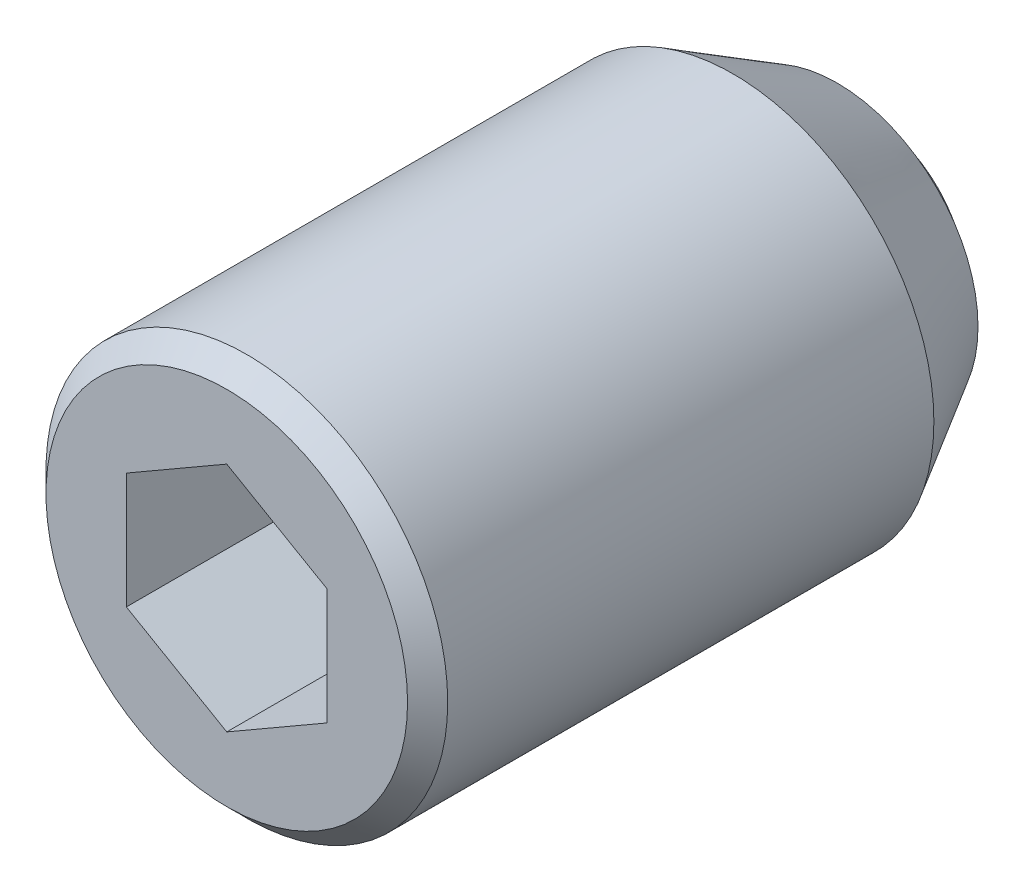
ISO-10303-21;
HEADER;
FILE_DESCRIPTION(('STEP AP214'),'2;1');
FILE_NAME('part.step','',(''),(''),'','','');
FILE_SCHEMA(('AUTOMOTIVE_DESIGN { 1 0 10303 214 1 1 1 1 }'));
ENDSEC;
DATA;
#1=APPLICATION_CONTEXT('core data for automotive mechanical design processes');
#2=APPLICATION_PROTOCOL_DEFINITION('international standard','automotive_design',2000,#1);
#3=PRODUCT_CONTEXT('',#1,'mechanical');
#4=PRODUCT('Part','Part','',(#3));
#5=PRODUCT_RELATED_PRODUCT_CATEGORY('part','',(#4));
#6=PRODUCT_DEFINITION_FORMATION('','',#4);
#7=PRODUCT_DEFINITION_CONTEXT('part definition',#1,'design');
#8=PRODUCT_DEFINITION('design','',#6,#7);
#9=PRODUCT_DEFINITION_SHAPE('','',#8);
#10=(LENGTH_UNIT() NAMED_UNIT(*) SI_UNIT(.MILLI.,.METRE.));
#11=(NAMED_UNIT(*) PLANE_ANGLE_UNIT() SI_UNIT($,.RADIAN.));
#12=(NAMED_UNIT(*) SI_UNIT($,.STERADIAN.) SOLID_ANGLE_UNIT());
#13=UNCERTAINTY_MEASURE_WITH_UNIT(LENGTH_MEASURE(1.E-05),#10,'distance_accuracy_value','');
#14=(GEOMETRIC_REPRESENTATION_CONTEXT(3) GLOBAL_UNCERTAINTY_ASSIGNED_CONTEXT((#13)) GLOBAL_UNIT_ASSIGNED_CONTEXT((#10,
#11,#12)) REPRESENTATION_CONTEXT('',''));
#15=CARTESIAN_POINT('',(0.,0.,0.));
#16=DIRECTION('',(0.,0.,1.));
#17=DIRECTION('',(1.,0.,0.));
#18=AXIS2_PLACEMENT_3D('',#15,#16,#17);
#19=CARTESIAN_POINT('',(1.25,0.721687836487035,5.5));
#20=DIRECTION('',(0.5,0.866025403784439,0.));
#21=DIRECTION('',(0.866025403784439,-0.5,0.));
#22=AXIS2_PLACEMENT_3D('',#19,#20,#21);
#23=PLANE('',#22);
#24=DIRECTION('',(0.,0.,1.));
#25=VECTOR('',#24,1.);
#26=CARTESIAN_POINT('',(1.25,0.721687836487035,5.5));
#27=LINE('',#26,#25);
#28=CARTESIAN_POINT('',(1.25,0.721687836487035,5.5));
#29=VERTEX_POINT('',#28);
#30=CARTESIAN_POINT('',(1.25,0.721687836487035,8.));
#31=VERTEX_POINT('',#30);
#32=EDGE_CURVE('E96',#29,#31,#27,.T.);
#33=ORIENTED_EDGE('',*,*,#32,.T.);
#34=DIRECTION('',(-0.866025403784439,0.5,0.));
#35=VECTOR('',#34,1.);
#36=CARTESIAN_POINT('',(1.25,0.721687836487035,8.));
#37=LINE('',#36,#35);
#38=CARTESIAN_POINT('',(0.,1.44337567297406,8.));
#39=VERTEX_POINT('',#38);
#40=EDGE_CURVE('E29',#31,#39,#37,.T.);
#41=ORIENTED_EDGE('',*,*,#40,.T.);
#42=DIRECTION('',(0.,0.,1.));
#43=VECTOR('',#42,1.);
#44=CARTESIAN_POINT('',(0.,1.44337567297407,5.5));
#45=LINE('',#44,#43);
#46=CARTESIAN_POINT('',(0.,1.44337567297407,5.5));
#47=VERTEX_POINT('',#46);
#48=EDGE_CURVE('E34',#47,#39,#45,.T.);
#49=ORIENTED_EDGE('',*,*,#48,.F.);
#50=DIRECTION('',(-0.866025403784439,0.5,0.));
#51=VECTOR('',#50,1.);
#52=CARTESIAN_POINT('',(1.25,0.721687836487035,5.5));
#53=LINE('',#52,#51);
#54=EDGE_CURVE('E90',#29,#47,#53,.T.);
#55=ORIENTED_EDGE('',*,*,#54,.F.);
#56=EDGE_LOOP('',(#33,#41,#49,#55));
#57=FACE_BOUND('',#56,.T.);
#58=ADVANCED_FACE('F14',(#57),#23,.F.);
#59=CARTESIAN_POINT('',(1.25,-0.721687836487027,5.5));
#60=DIRECTION('',(1.,0.,0.));
#61=DIRECTION('',(0.,-1.,0.));
#62=AXIS2_PLACEMENT_3D('',#59,#60,#61);
#63=PLANE('',#62);
#64=DIRECTION('',(0.,0.,1.));
#65=VECTOR('',#64,1.);
#66=CARTESIAN_POINT('',(1.25,-0.721687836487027,5.5));
#67=LINE('',#66,#65);
#68=CARTESIAN_POINT('',(1.25,-0.721687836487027,5.5));
#69=VERTEX_POINT('',#68);
#70=CARTESIAN_POINT('',(1.25,-0.721687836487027,8.));
#71=VERTEX_POINT('',#70);
#72=EDGE_CURVE('E93',#69,#71,#67,.T.);
#73=ORIENTED_EDGE('',*,*,#72,.T.);
#74=DIRECTION('',(0.,1.,0.));
#75=VECTOR('',#74,1.);
#76=CARTESIAN_POINT('',(1.25,-0.721687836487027,8.));
#77=LINE('',#76,#75);
#78=EDGE_CURVE('E150',#71,#31,#77,.T.);
#79=ORIENTED_EDGE('',*,*,#78,.T.);
#80=ORIENTED_EDGE('',*,*,#32,.F.);
#81=DIRECTION('',(0.,1.,0.));
#82=VECTOR('',#81,1.);
#83=CARTESIAN_POINT('',(1.25,-0.721687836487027,5.5));
#84=LINE('',#83,#82);
#85=EDGE_CURVE('E85',#69,#29,#84,.T.);
#86=ORIENTED_EDGE('',*,*,#85,.F.);
#87=EDGE_LOOP('',(#73,#79,#80,#86));
#88=FACE_BOUND('',#87,.T.);
#89=ADVANCED_FACE('F119',(#88),#63,.F.);
#90=CARTESIAN_POINT('',(1.25,-0.721687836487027,5.5));
#91=DIRECTION('',(-0.5,0.866025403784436,0.));
#92=DIRECTION('',(0.866025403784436,0.5,0.));
#93=AXIS2_PLACEMENT_3D('',#90,#91,#92);
#94=PLANE('',#93);
#95=DIRECTION('',(0.,0.,1.));
#96=VECTOR('',#95,1.);
#97=CARTESIAN_POINT('',(0.,-1.44337567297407,5.5));
#98=LINE('',#97,#96);
#99=CARTESIAN_POINT('',(0.,-1.44337567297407,5.5));
#100=VERTEX_POINT('',#99);
#101=CARTESIAN_POINT('',(0.,-1.44337567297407,8.));
#102=VERTEX_POINT('',#101);
#103=EDGE_CURVE('E68',#100,#102,#98,.T.);
#104=ORIENTED_EDGE('',*,*,#103,.T.);
#105=DIRECTION('',(-0.866025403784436,-0.5,0.));
#106=VECTOR('',#105,1.);
#107=CARTESIAN_POINT('',(1.25,-0.721687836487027,8.));
#108=LINE('',#107,#106);
#109=EDGE_CURVE('E144',#71,#102,#108,.T.);
#110=ORIENTED_EDGE('',*,*,#109,.F.);
#111=ORIENTED_EDGE('',*,*,#72,.F.);
#112=DIRECTION('',(-0.866025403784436,-0.5,0.));
#113=VECTOR('',#112,1.);
#114=CARTESIAN_POINT('',(1.25,-0.721687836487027,5.5));
#115=LINE('',#114,#113);
#116=EDGE_CURVE('E83',#69,#100,#115,.T.);
#117=ORIENTED_EDGE('',*,*,#116,.T.);
#118=EDGE_LOOP('',(#104,#110,#111,#117));
#119=FACE_BOUND('',#118,.T.);
#120=ADVANCED_FACE('F124',(#119),#94,.T.);
#121=CARTESIAN_POINT('',(-1.25,-0.721687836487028,5.5));
#122=DIRECTION('',(-0.5,-0.866025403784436,0.));
#123=DIRECTION('',(-0.866025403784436,0.5,0.));
#124=AXIS2_PLACEMENT_3D('',#121,#122,#123);
#125=PLANE('',#124);
#126=DIRECTION('',(0.,0.,1.));
#127=VECTOR('',#126,1.);
#128=CARTESIAN_POINT('',(-1.25,-0.721687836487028,5.5));
#129=LINE('',#128,#127);
#130=CARTESIAN_POINT('',(-1.25,-0.721687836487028,5.5));
#131=VERTEX_POINT('',#130);
#132=CARTESIAN_POINT('',(-1.25,-0.721687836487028,8.));
#133=VERTEX_POINT('',#132);
#134=EDGE_CURVE('E56',#131,#133,#129,.T.);
#135=ORIENTED_EDGE('',*,*,#134,.T.);
#136=DIRECTION('',(0.866025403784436,-0.5,0.));
#137=VECTOR('',#136,1.);
#138=CARTESIAN_POINT('',(-1.25,-0.721687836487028,8.));
#139=LINE('',#138,#137);
#140=EDGE_CURVE('E147',#133,#102,#139,.T.);
#141=ORIENTED_EDGE('',*,*,#140,.T.);
#142=ORIENTED_EDGE('',*,*,#103,.F.);
#143=DIRECTION('',(0.866025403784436,-0.5,0.));
#144=VECTOR('',#143,1.);
#145=CARTESIAN_POINT('',(-1.25,-0.721687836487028,5.5));
#146=LINE('',#145,#144);
#147=EDGE_CURVE('E76',#131,#100,#146,.T.);
#148=ORIENTED_EDGE('',*,*,#147,.F.);
#149=EDGE_LOOP('',(#135,#141,#142,#148));
#150=FACE_BOUND('',#149,.T.);
#151=ADVANCED_FACE('F81',(#150),#125,.F.);
#152=CARTESIAN_POINT('',(-1.25,-0.721687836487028,5.5));
#153=DIRECTION('',(1.,0.,0.));
#154=DIRECTION('',(0.,0.,1.));
#155=AXIS2_PLACEMENT_3D('',#152,#153,#154);
#156=PLANE('',#155);
#157=DIRECTION('',(0.,0.,1.));
#158=VECTOR('',#157,1.);
#159=CARTESIAN_POINT('',(-1.25,0.72168783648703,5.5));
#160=LINE('',#159,#158);
#161=CARTESIAN_POINT('',(-1.25,0.72168783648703,5.5));
#162=VERTEX_POINT('',#161);
#163=CARTESIAN_POINT('',(-1.25,0.72168783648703,8.));
#164=VERTEX_POINT('',#163);
#165=EDGE_CURVE('E69',#162,#164,#160,.T.);
#166=ORIENTED_EDGE('',*,*,#165,.T.);
#167=DIRECTION('',(0.,1.,0.));
#168=VECTOR('',#167,1.);
#169=CARTESIAN_POINT('',(-1.25,-0.721687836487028,8.));
#170=LINE('',#169,#168);
#171=EDGE_CURVE('E63',#133,#164,#170,.T.);
#172=ORIENTED_EDGE('',*,*,#171,.F.);
#173=ORIENTED_EDGE('',*,*,#134,.F.);
#174=DIRECTION('',(0.,1.,0.));
#175=VECTOR('',#174,1.);
#176=CARTESIAN_POINT('',(-1.25,-0.721687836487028,5.5));
#177=LINE('',#176,#175);
#178=EDGE_CURVE('E60',#131,#162,#177,.T.);
#179=ORIENTED_EDGE('',*,*,#178,.T.);
#180=EDGE_LOOP('',(#166,#172,#173,#179));
#181=FACE_BOUND('',#180,.T.);
#182=ADVANCED_FACE('F59',(#181),#156,.T.);
#183=CARTESIAN_POINT('',(-1.25,0.72168783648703,5.5));
#184=DIRECTION('',(0.5,-0.866025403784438,0.));
#185=DIRECTION('',(-0.866025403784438,-0.5,0.));
#186=AXIS2_PLACEMENT_3D('',#183,#184,#185);
#187=PLANE('',#186);
#188=DIRECTION('',(0.866025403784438,0.5,0.));
#189=VECTOR('',#188,1.);
#190=CARTESIAN_POINT('',(-1.25,0.72168783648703,5.5));
#191=LINE('',#190,#189);
#192=EDGE_CURVE('E79',#162,#47,#191,.T.);
#193=ORIENTED_EDGE('',*,*,#192,.T.);
#194=ORIENTED_EDGE('',*,*,#48,.T.);
#195=DIRECTION('',(0.866025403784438,0.5,0.));
#196=VECTOR('',#195,1.);
#197=CARTESIAN_POINT('',(-1.25,0.72168783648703,8.));
#198=LINE('',#197,#196);
#199=EDGE_CURVE('E157',#164,#39,#198,.T.);
#200=ORIENTED_EDGE('',*,*,#199,.F.);
#201=ORIENTED_EDGE('',*,*,#165,.F.);
#202=EDGE_LOOP('',(#193,#194,#200,#201));
#203=FACE_BOUND('',#202,.T.);
#204=ADVANCED_FACE('F128',(#203),#187,.T.);
#205=CARTESIAN_POINT('',(2.5,0.,5.5));
#206=DIRECTION('',(0.,0.,1.));
#207=DIRECTION('',(-1.,0.,0.));
#208=AXIS2_PLACEMENT_3D('',#205,#206,#207);
#209=PLANE('',#208);
#210=ORIENTED_EDGE('',*,*,#54,.T.);
#211=ORIENTED_EDGE('',*,*,#192,.F.);
#212=ORIENTED_EDGE('',*,*,#178,.F.);
#213=ORIENTED_EDGE('',*,*,#147,.T.);
#214=ORIENTED_EDGE('',*,*,#116,.F.);
#215=ORIENTED_EDGE('',*,*,#85,.T.);
#216=EDGE_LOOP('',(#210,#211,#212,#213,#214,#215));
#217=FACE_BOUND('',#216,.T.);
#218=ADVANCED_FACE('F74',(#217),#209,.T.);
#219=CARTESIAN_POINT('',(0.,0.,7.75));
#220=DIRECTION('',(0.,0.,-1.));
#221=DIRECTION('',(1.,0.,0.));
#222=AXIS2_PLACEMENT_3D('',#219,#220,#221);
#223=CYLINDRICAL_SURFACE('',#222,2.5);
#224=CARTESIAN_POINT('',(0.,0.,7.75));
#225=DIRECTION('',(0.,0.,-1.));
#226=DIRECTION('',(1.,0.,0.));
#227=AXIS2_PLACEMENT_3D('',#224,#225,#226);
#228=CIRCLE('',#227,2.5);
#229=CARTESIAN_POINT('',(2.5,0.,7.75));
#230=VERTEX_POINT('',#229);
#231=EDGE_CURVE('E9',#230,#230,#228,.T.);
#232=ORIENTED_EDGE('',*,*,#231,.T.);
#233=EDGE_LOOP('',(#232));
#234=FACE_BOUND('',#233,.T.);
#235=CARTESIAN_POINT('',(0.,0.,1.69903810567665));
#236=DIRECTION('',(0.,0.,-1.));
#237=DIRECTION('',(-1.,0.,0.));
#238=AXIS2_PLACEMENT_3D('',#235,#236,#237);
#239=CIRCLE('',#238,2.5);
#240=CARTESIAN_POINT('',(-2.5,0.,1.69903810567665));
#241=VERTEX_POINT('',#240);
#242=EDGE_CURVE('E175',#241,#241,#239,.T.);
#243=ORIENTED_EDGE('',*,*,#242,.F.);
#244=EDGE_LOOP('',(#243));
#245=FACE_BOUND('',#244,.T.);
#246=ADVANCED_FACE('F16',(#234,#245),#223,.T.);
#247=CARTESIAN_POINT('',(0.,0.,7.75));
#248=DIRECTION('',(0.,0.,-1.));
#249=DIRECTION('',(1.,0.,0.));
#250=AXIS2_PLACEMENT_3D('',#247,#248,#249);
#251=CONICAL_SURFACE('',#250,2.5,0.785398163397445);
#252=CARTESIAN_POINT('',(0.,0.,8.));
#253=DIRECTION('',(0.,0.,-1.));
#254=DIRECTION('',(1.,0.,0.));
#255=AXIS2_PLACEMENT_3D('',#252,#253,#254);
#256=CIRCLE('',#255,2.25);
#257=CARTESIAN_POINT('',(2.25,0.,8.));
#258=VERTEX_POINT('',#257);
#259=EDGE_CURVE('E22',#258,#258,#256,.T.);
#260=ORIENTED_EDGE('',*,*,#259,.T.);
#261=EDGE_LOOP('',(#260));
#262=FACE_BOUND('',#261,.T.);
#263=ORIENTED_EDGE('',*,*,#231,.F.);
#264=EDGE_LOOP('',(#263));
#265=FACE_BOUND('',#264,.T.);
#266=ADVANCED_FACE('F100',(#262,#265),#251,.T.);
#267=CARTESIAN_POINT('',(0.,0.,8.));
#268=DIRECTION('',(0.,0.,-1.));
#269=DIRECTION('',(1.,0.,0.));
#270=AXIS2_PLACEMENT_3D('',#267,#268,#269);
#271=PLANE('',#270);
#272=ORIENTED_EDGE('',*,*,#199,.T.);
#273=ORIENTED_EDGE('',*,*,#40,.F.);
#274=ORIENTED_EDGE('',*,*,#78,.F.);
#275=ORIENTED_EDGE('',*,*,#109,.T.);
#276=ORIENTED_EDGE('',*,*,#140,.F.);
#277=ORIENTED_EDGE('',*,*,#171,.T.);
#278=EDGE_LOOP('',(#272,#273,#274,#275,#276,#277));
#279=FACE_BOUND('',#278,.T.);
#280=ORIENTED_EDGE('',*,*,#259,.F.);
#281=EDGE_LOOP('',(#280));
#282=FACE_BOUND('',#281,.T.);
#283=ADVANCED_FACE('F103',(#279,#282),#271,.F.);
#284=CARTESIAN_POINT('',(0.,0.,0.));
#285=DIRECTION('',(0.,0.,-1.));
#286=DIRECTION('',(-1.,0.,0.));
#287=AXIS2_PLACEMENT_3D('',#284,#285,#286);
#288=PLANE('',#287);
#289=CARTESIAN_POINT('',(0.,0.,0.));
#290=DIRECTION('',(0.,0.,-1.));
#291=DIRECTION('',(-1.,0.,0.));
#292=AXIS2_PLACEMENT_3D('',#289,#290,#291);
#293=CIRCLE('',#292,1.2);
#294=CARTESIAN_POINT('',(-1.2,0.,0.));
#295=VERTEX_POINT('',#294);
#296=EDGE_CURVE('E152',#295,#295,#293,.T.);
#297=ORIENTED_EDGE('',*,*,#296,.T.);
#298=EDGE_LOOP('',(#297));
#299=FACE_BOUND('',#298,.T.);
#300=ADVANCED_FACE('F105',(#299),#288,.T.);
#301=CARTESIAN_POINT('',(0.,0.,0.9));
#302=DIRECTION('',(0.,0.,-1.));
#303=DIRECTION('',(-1.,0.,0.));
#304=AXIS2_PLACEMENT_3D('',#301,#302,#303);
#305=SPHERICAL_SURFACE('',#304,1.5);
#306=CARTESIAN_POINT('',(0.,0.,0.4));
#307=DIRECTION('',(0.,0.,-1.));
#308=DIRECTION('',(-1.,0.,0.));
#309=AXIS2_PLACEMENT_3D('',#306,#307,#308);
#310=CIRCLE('',#309,1.41421356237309);
#311=CARTESIAN_POINT('',(-1.41421356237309,0.,0.4));
#312=VERTEX_POINT('',#311);
#313=EDGE_CURVE('E169',#312,#312,#310,.T.);
#314=CARTESIAN_POINT('',(-1.41421356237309,0.,0.4));
#315=CARTESIAN_POINT('',(-1.41263197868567,0.,0.395526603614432));
#316=CARTESIAN_POINT('',(-1.41102916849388,0.,0.391060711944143));
#317=CARTESIAN_POINT('',(-1.4077812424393,0.,0.382144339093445));
#318=CARTESIAN_POINT('',(-1.40613612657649,0.,0.377693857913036));
#319=CARTESIAN_POINT('',(-1.40280373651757,0.,0.368808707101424));
#320=CARTESIAN_POINT('',(-1.40111646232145,0.,0.364374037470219));
#321=CARTESIAN_POINT('',(-1.39769990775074,0.,0.355520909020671));
#322=CARTESIAN_POINT('',(-1.39597062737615,0.,0.351102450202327));
#323=CARTESIAN_POINT('',(-1.3924702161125,0.,0.342282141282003));
#324=CARTESIAN_POINT('',(-1.39069908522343,0.,0.337880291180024));
#325=CARTESIAN_POINT('',(-1.38711513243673,0.,0.329093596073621));
#326=CARTESIAN_POINT('',(-1.38530231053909,0.,0.324708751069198));
#327=CARTESIAN_POINT('',(-1.38163513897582,0.,0.315956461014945));
#328=CARTESIAN_POINT('',(-1.37978078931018,0.,0.311589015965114));
#329=CARTESIAN_POINT('',(-1.3760307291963,0.,0.302871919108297));
#330=CARTESIAN_POINT('',(-1.37413501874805,0.,0.29852226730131));
#331=CARTESIAN_POINT('',(-1.37030240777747,0.,0.289841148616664));
#332=CARTESIAN_POINT('',(-1.36836550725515,0.,0.285509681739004));
#333=CARTESIAN_POINT('',(-1.36445069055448,0.,0.276865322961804));
#334=CARTESIAN_POINT('',(-1.36247277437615,0.,0.272552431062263));
#335=CARTESIAN_POINT('',(-1.35847610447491,0.,0.263945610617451));
#336=CARTESIAN_POINT('',(-1.356457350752,0.,0.25965168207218));
#337=CARTESIAN_POINT('',(-1.3523791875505,0.,0.251083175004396));
#338=CARTESIAN_POINT('',(-1.3503197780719,0.,0.246808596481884));
#339=CARTESIAN_POINT('',(-1.34616048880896,0.,0.238279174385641));
#340=CARTESIAN_POINT('',(-1.34406060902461,0.,0.23402433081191));
#341=CARTESIAN_POINT('',(-1.33982056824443,0.,0.225534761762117));
#342=CARTESIAN_POINT('',(-1.33768040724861,0.,0.221300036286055));
#343=CARTESIAN_POINT('',(-1.3333599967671,0.,0.212851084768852));
#344=CARTESIAN_POINT('',(-1.33117974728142,0.,0.208636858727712));
#345=CARTESIAN_POINT('',(-1.32677935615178,0.,0.200229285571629));
#346=CARTESIAN_POINT('',(-1.32455921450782,0.,0.196035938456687));
#347=CARTESIAN_POINT('',(-1.32007923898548,0.,0.187670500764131));
#348=CARTESIAN_POINT('',(-1.31781940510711,0.,0.183498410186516));
#349=CARTESIAN_POINT('',(-1.31326024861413,0.,0.175175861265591));
#350=CARTESIAN_POINT('',(-1.31096092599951,0.,0.17102540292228));
#351=CARTESIAN_POINT('',(-1.30632299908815,0.,0.162746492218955));
#352=CARTESIAN_POINT('',(-1.30398439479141,0.,0.158618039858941));
#353=CARTESIAN_POINT('',(-1.29926811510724,0.,0.150383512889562));
#354=CARTESIAN_POINT('',(-1.29689043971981,0.,0.146277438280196));
#355=CARTESIAN_POINT('',(-1.29209623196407,0.,0.13808803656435));
#356=CARTESIAN_POINT('',(-1.28967969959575,0.,0.134004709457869));
#357=CARTESIAN_POINT('',(-1.2848079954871,0.,0.125861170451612));
#358=CARTESIAN_POINT('',(-1.28235282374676,0.,0.121800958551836));
#359=CARTESIAN_POINT('',(-1.27740406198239,0.,0.113704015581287));
#360=CARTESIAN_POINT('',(-1.27491047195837,0.,0.109667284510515));
#361=CARTESIAN_POINT('',(-1.26988509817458,0.,0.101617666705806));
#362=CARTESIAN_POINT('',(-1.2673533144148,0.,0.09760477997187));
#363=CARTESIAN_POINT('',(-1.2622517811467,0.,0.0896032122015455));
#364=CARTESIAN_POINT('',(-1.25968203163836,0.,0.0856145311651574));
#365=CARTESIAN_POINT('',(-1.25450479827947,0.,0.0776617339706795));
#366=CARTESIAN_POINT('',(-1.25189731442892,0.,0.0736976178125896));
#367=CARTESIAN_POINT('',(-1.24664484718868,0.,0.0657943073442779));
#368=CARTESIAN_POINT('',(-1.24399986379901,0.,0.061855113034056));
#369=CARTESIAN_POINT('',(-1.23867263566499,0.,0.0540020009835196));
#370=CARTESIAN_POINT('',(-1.23599039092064,0.,0.0500880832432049));
#371=CARTESIAN_POINT('',(-1.23058888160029,0.,0.042285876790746));
#372=CARTESIAN_POINT('',(-1.22786961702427,0.,0.0383975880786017));
#373=CARTESIAN_POINT('',(-1.22239431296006,0.,0.0306469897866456));
#374=CARTESIAN_POINT('',(-1.21963827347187,0.,0.0267846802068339));
#375=CARTESIAN_POINT('',(-1.21408966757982,0.,0.0190863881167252));
#376=CARTESIAN_POINT('',(-1.21129710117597,0.,0.0152504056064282));
#377=CARTESIAN_POINT('',(-1.20567569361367,0.,0.00760511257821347));
#378=CARTESIAN_POINT('',(-1.20284685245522,0.,0.00379580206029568));
#379=CARTESIAN_POINT('',(-1.2,0.,0.));
#380=B_SPLINE_CURVE_WITH_KNOTS('',3,(#314,#315,#316,#317,#318,#319,#320,#321,#322,#323,#324,
#325,#326,#327,#328,#329,#330,#331,#332,#333,#334,#335,#336,#337,#338,#339,#340,#341,#342,#343,
#344,#345,#346,#347,#348,#349,#350,#351,#352,#353,#354,#355,#356,#357,#358,#359,#360,#361,#362,
#363,#364,#365,#366,#367,#368,#369,#370,#371,#372,#373,#374,#375,#376,#377,#378,#379),
.UNSPECIFIED.,.F.,.F.,(4,2,2,2,2,2,2,2,2,2,2,2,2,2,2,2,2,2,2,2,2,2,2,2,2,2,2,2,2,2,2,2,4),(0.,
0.014234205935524,0.0284684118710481,0.0427026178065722,0.0569368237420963,0.0711710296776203,
0.0854052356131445,0.0996394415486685,0.113873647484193,0.128107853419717,0.142342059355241,
0.156576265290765,0.170810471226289,0.185044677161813,0.199278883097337,0.213513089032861,
0.227747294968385,0.241981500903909,0.256215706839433,0.270449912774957,0.284684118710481,
0.298918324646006,0.31315253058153,0.327386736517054,0.341620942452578,0.355855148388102,
0.370089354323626,0.38432356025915,0.398557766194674,0.412791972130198,0.427026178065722,
0.441260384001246,0.45549458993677),.UNSPECIFIED.);
#381=EDGE_CURVE('BSEAM113',#312,#295,#380,.T.);
#382=ORIENTED_EDGE('',*,*,#313,.T.);
#383=ORIENTED_EDGE('',*,*,#296,.F.);
#384=ORIENTED_EDGE('',*,*,#381,.T.);
#385=ORIENTED_EDGE('',*,*,#381,.F.);
#386=EDGE_LOOP('',(#382,#384,#383,#385));
#387=FACE_BOUND('',#386,.T.);
#388=ADVANCED_FACE('F113',(#387),#305,.T.);
#389=CARTESIAN_POINT('',(-1.41421356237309,0.,0.4));
#390=DIRECTION('',(0.,0.,-1.));
#391=DIRECTION('',(-1.,0.,0.));
#392=AXIS2_PLACEMENT_3D('',#389,#390,#391);
#393=PLANE('',#392);
#394=CARTESIAN_POINT('',(0.,0.,0.4));
#395=DIRECTION('',(0.,0.,-1.));
#396=DIRECTION('',(-1.,0.,0.));
#397=AXIS2_PLACEMENT_3D('',#394,#395,#396);
#398=CIRCLE('',#397,1.75);
#399=CARTESIAN_POINT('',(-1.75,0.,0.4));
#400=VERTEX_POINT('',#399);
#401=EDGE_CURVE('E172',#400,#400,#398,.T.);
#402=ORIENTED_EDGE('',*,*,#401,.T.);
#403=EDGE_LOOP('',(#402));
#404=FACE_BOUND('',#403,.T.);
#405=ORIENTED_EDGE('',*,*,#313,.F.);
#406=EDGE_LOOP('',(#405));
#407=FACE_BOUND('',#406,.T.);
#408=ADVANCED_FACE('F252',(#404,#407),#393,.T.);
#409=CARTESIAN_POINT('',(0.,0.,0.4));
#410=DIRECTION('',(0.,0.,1.));
#411=DIRECTION('',(1.,0.,0.));
#412=AXIS2_PLACEMENT_3D('',#409,#410,#411);
#413=CONICAL_SURFACE('',#412,1.75,0.523598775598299);
#414=ORIENTED_EDGE('',*,*,#242,.T.);
#415=EDGE_LOOP('',(#414));
#416=FACE_BOUND('',#415,.T.);
#417=ORIENTED_EDGE('',*,*,#401,.F.);
#418=EDGE_LOOP('',(#417));
#419=FACE_BOUND('',#418,.T.);
#420=ADVANCED_FACE('F179',(#416,#419),#413,.T.);
#421=CLOSED_SHELL('',(#58,#89,#120,#151,#182,#204,#218,#246,#266,#283,#300,#388,#408,#420));
#422=MANIFOLD_SOLID_BREP('B1',#421);
#423=ADVANCED_BREP_SHAPE_REPRESENTATION('',(#18,#422),#14);
#424=SHAPE_DEFINITION_REPRESENTATION(#9,#423);
ENDSEC;
END-ISO-10303-21;
